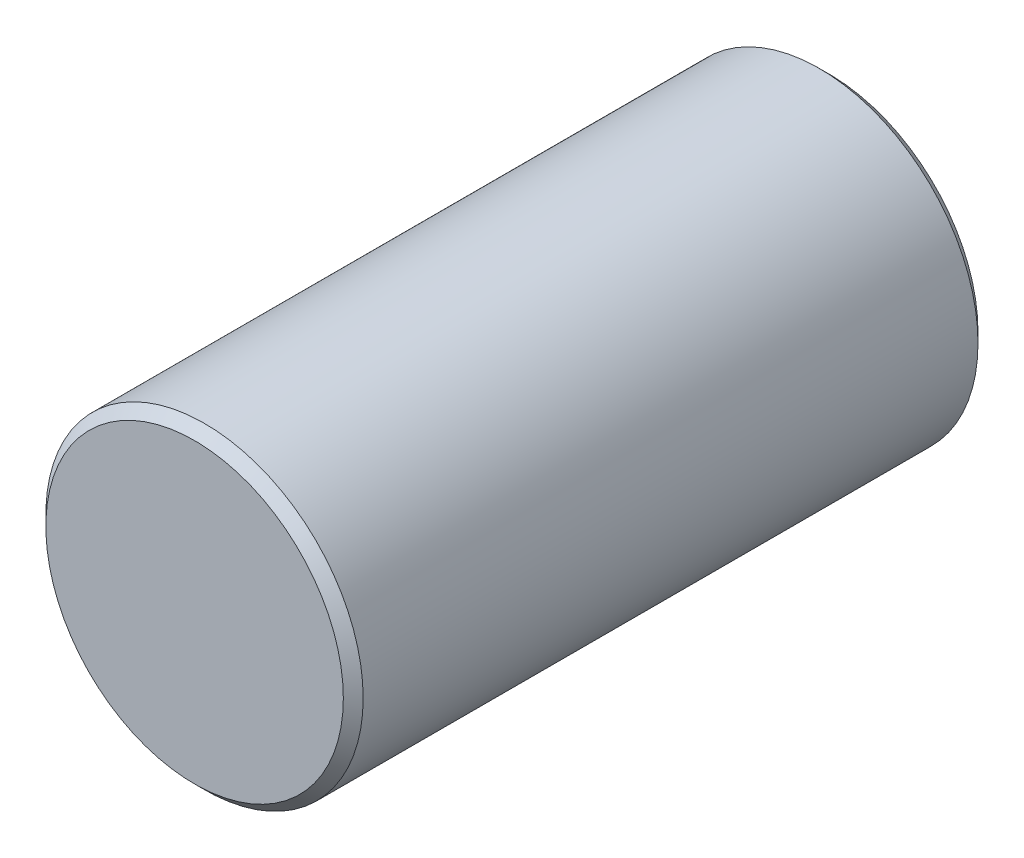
ISO-10303-21;
HEADER;
FILE_DESCRIPTION(('STEP AP214'),'2;1');
FILE_NAME('part.step','',(''),(''),'','','');
FILE_SCHEMA(('AUTOMOTIVE_DESIGN { 1 0 10303 214 1 1 1 1 }'));
ENDSEC;
DATA;
#1=APPLICATION_CONTEXT('core data for automotive mechanical design processes');
#2=APPLICATION_PROTOCOL_DEFINITION('international standard','automotive_design',2000,#1);
#3=PRODUCT_CONTEXT('',#1,'mechanical');
#4=PRODUCT('Part','Part','',(#3));
#5=PRODUCT_RELATED_PRODUCT_CATEGORY('part','',(#4));
#6=PRODUCT_DEFINITION_FORMATION('','',#4);
#7=PRODUCT_DEFINITION_CONTEXT('part definition',#1,'design');
#8=PRODUCT_DEFINITION('design','',#6,#7);
#9=PRODUCT_DEFINITION_SHAPE('','',#8);
#10=(LENGTH_UNIT() NAMED_UNIT(*) SI_UNIT(.MILLI.,.METRE.));
#11=(NAMED_UNIT(*) PLANE_ANGLE_UNIT() SI_UNIT($,.RADIAN.));
#12=(NAMED_UNIT(*) SI_UNIT($,.STERADIAN.) SOLID_ANGLE_UNIT());
#13=UNCERTAINTY_MEASURE_WITH_UNIT(LENGTH_MEASURE(1.E-05),#10,'distance_accuracy_value','');
#14=(GEOMETRIC_REPRESENTATION_CONTEXT(3) GLOBAL_UNCERTAINTY_ASSIGNED_CONTEXT((#13)) GLOBAL_UNIT_ASSIGNED_CONTEXT((#10,
#11,#12)) REPRESENTATION_CONTEXT('',''));
#15=CARTESIAN_POINT('',(0.,0.,0.));
#16=DIRECTION('',(0.,0.,1.));
#17=DIRECTION('',(1.,0.,0.));
#18=AXIS2_PLACEMENT_3D('',#15,#16,#17);
#19=CARTESIAN_POINT('',(0.,0.,-10.6746912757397));
#20=DIRECTION('',(0.,0.,1.));
#21=DIRECTION('',(1.,0.,0.));
#22=AXIS2_PLACEMENT_3D('',#19,#20,#21);
#23=CYLINDRICAL_SURFACE('',#22,4.);
#24=CARTESIAN_POINT('',(0.,0.,-0.250013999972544));
#25=DIRECTION('',(0.,0.,1.));
#26=DIRECTION('',(1.,0.,0.));
#27=AXIS2_PLACEMENT_3D('',#24,#25,#26);
#28=CIRCLE('',#27,4.);
#29=CARTESIAN_POINT('',(4.,0.,-0.250013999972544));
#30=VERTEX_POINT('',#29);
#31=EDGE_CURVE('E10',#30,#30,#28,.T.);
#32=ORIENTED_EDGE('',*,*,#31,.F.);
#33=EDGE_LOOP('',(#32));
#34=FACE_BOUND('',#33,.T.);
#35=CARTESIAN_POINT('',(0.,0.,-15.7499860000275));
#36=DIRECTION('',(0.,0.,1.));
#37=DIRECTION('',(1.,0.,0.));
#38=AXIS2_PLACEMENT_3D('',#35,#36,#37);
#39=CIRCLE('',#38,4.);
#40=CARTESIAN_POINT('',(4.,0.,-15.7499860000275));
#41=VERTEX_POINT('',#40);
#42=EDGE_CURVE('E44',#41,#41,#39,.T.);
#43=ORIENTED_EDGE('',*,*,#42,.T.);
#44=EDGE_LOOP('',(#43));
#45=FACE_BOUND('',#44,.T.);
#46=ADVANCED_FACE('F30',(#34,#45),#23,.T.);
#47=CARTESIAN_POINT('',(0.,0.,-0.250013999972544));
#48=DIRECTION('',(0.,0.,-1.));
#49=DIRECTION('',(-1.,0.,0.));
#50=AXIS2_PLACEMENT_3D('',#47,#48,#49);
#51=CONICAL_SURFACE('',#50,4.,0.785398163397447);
#52=CARTESIAN_POINT('',(0.,0.,0.));
#53=DIRECTION('',(0.,0.,1.));
#54=DIRECTION('',(1.,0.,0.));
#55=AXIS2_PLACEMENT_3D('',#52,#53,#54);
#56=CIRCLE('',#55,3.74998600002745);
#57=CARTESIAN_POINT('',(3.74998600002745,0.,0.));
#58=VERTEX_POINT('',#57);
#59=EDGE_CURVE('E36',#58,#58,#56,.T.);
#60=ORIENTED_EDGE('',*,*,#59,.F.);
#61=EDGE_LOOP('',(#60));
#62=FACE_BOUND('',#61,.T.);
#63=ORIENTED_EDGE('',*,*,#31,.T.);
#64=EDGE_LOOP('',(#63));
#65=FACE_BOUND('',#64,.T.);
#66=ADVANCED_FACE('F64',(#62,#65),#51,.T.);
#67=CARTESIAN_POINT('',(0.,3.74998600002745,0.));
#68=DIRECTION('',(0.,0.,-1.));
#69=DIRECTION('',(-1.,0.,0.));
#70=AXIS2_PLACEMENT_3D('',#67,#68,#69);
#71=PLANE('',#70);
#72=ORIENTED_EDGE('',*,*,#59,.T.);
#73=EDGE_LOOP('',(#72));
#74=FACE_BOUND('',#73,.T.);
#75=ADVANCED_FACE('F59',(#74),#71,.F.);
#76=CARTESIAN_POINT('',(0.,0.,-16.));
#77=DIRECTION('',(0.,0.,1.));
#78=DIRECTION('',(1.,0.,0.));
#79=AXIS2_PLACEMENT_3D('',#76,#77,#78);
#80=PLANE('',#79);
#81=CARTESIAN_POINT('',(0.,0.,-16.));
#82=DIRECTION('',(0.,0.,1.));
#83=DIRECTION('',(1.,0.,0.));
#84=AXIS2_PLACEMENT_3D('',#81,#82,#83);
#85=CIRCLE('',#84,3.74998600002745);
#86=CARTESIAN_POINT('',(3.74998600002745,0.,-16.));
#87=VERTEX_POINT('',#86);
#88=EDGE_CURVE('E40',#87,#87,#85,.T.);
#89=ORIENTED_EDGE('',*,*,#88,.F.);
#90=EDGE_LOOP('',(#89));
#91=FACE_BOUND('',#90,.T.);
#92=ADVANCED_FACE('F54',(#91),#80,.F.);
#93=CARTESIAN_POINT('',(0.,0.,-16.));
#94=DIRECTION('',(0.,0.,1.));
#95=DIRECTION('',(1.,0.,0.));
#96=AXIS2_PLACEMENT_3D('',#93,#94,#95);
#97=CONICAL_SURFACE('',#96,3.74998600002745,0.785398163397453);
#98=ORIENTED_EDGE('',*,*,#42,.F.);
#99=EDGE_LOOP('',(#98));
#100=FACE_BOUND('',#99,.T.);
#101=ORIENTED_EDGE('',*,*,#88,.T.);
#102=EDGE_LOOP('',(#101));
#103=FACE_BOUND('',#102,.T.);
#104=ADVANCED_FACE('F51',(#100,#103),#97,.T.);
#105=CLOSED_SHELL('',(#46,#66,#75,#92,#104));
#106=MANIFOLD_SOLID_BREP('B2',#105);
#107=ADVANCED_BREP_SHAPE_REPRESENTATION('',(#18,#106),#14);
#108=SHAPE_DEFINITION_REPRESENTATION(#9,#107);
ENDSEC;
END-ISO-10303-21;
